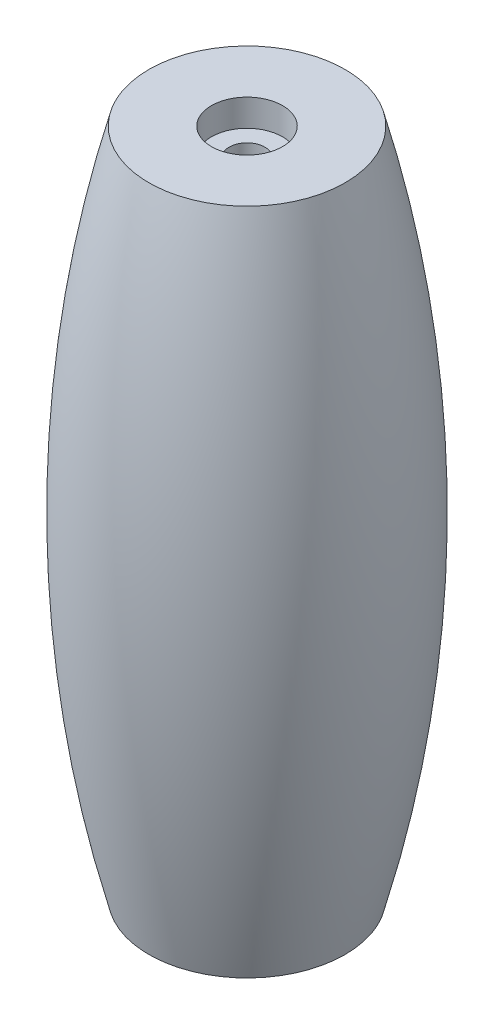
from build123d import *

# Parameters (mm, degrees)
SKETCH7_R          = 1.25
CUT_EXTRUDE6_DEPTH = 57.142405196
SKETCH8_R          = 2.5
CUT_EXTRUDE7_DEPTH = 1.9
CUT_EXTRUDE8_START = -1.9
SKETCH9_R          = 2.5
CUT_EXTRUDE8_DEPTH = 1.9
SCALE1_SCALE       = 0.95
SCALE2_SCALE       = 1.052631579
SCALE3_SCALE       = 0.94


with BuildPart() as part:
    # Sketch4 → Revolve2 (revolve)
    with BuildSketch(Plane.XY, mode=Mode.PRIVATE) as revolve2_sk:
        with BuildLine():
            ThreePointArc((-12.188062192, 14.080894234), (-9.13116282, -9.419105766), (-12.188062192, -32.919105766))
            Line((-12.188062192, -32.919105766), (-19.089678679, -32.919105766))
            Line((-19.089678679, -32.919105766), (-19.089678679, 14.080894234))
            Line((-19.089678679, 14.080894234), (-12.188062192, 14.080894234))
        make_face()
    revolve(revolve2_sk.sketch.rotate(Axis((-19.089678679, 14.080894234, 0), (0, -1, 0)), 180), axis=Axis((-19.089678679, 14.080894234, 0), (0, -1, 0)))

    # Sketch7 → Cut-Extrude6 (cut, through all)
    with BuildSketch(Plane(origin=(0, 14.080894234, 0), x_dir=(1, 0, 0), z_dir=(0, 1, 0))):
        with Locations(Location((-19.089678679, 0, 0), (0, 0, 180))):
            Circle(SKETCH7_R)
    extrude(amount=-CUT_EXTRUDE6_DEPTH, mode=Mode.SUBTRACT)

    # Sketch8 → Cut-Extrude7 (cut)
    with BuildSketch(Plane.XZ.offset(32.919105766)):
        with Locations((-19.089678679, 0)):
            Circle(SKETCH8_R)
    extrude(amount=-CUT_EXTRUDE7_DEPTH, mode=Mode.SUBTRACT)

    # Sketch9 → Cut-Extrude8 (cut)
    with BuildSketch(Plane(origin=(0, 14.080894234, 0), x_dir=(1, 0, 0), z_dir=(0, 1, 0)).offset(CUT_EXTRUDE8_START)):
        with Locations((-19.089678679, 0)):
            Circle(SKETCH9_R)
    extrude(amount=CUT_EXTRUDE8_DEPTH, mode=Mode.SUBTRACT)


with BuildPart() as part_1:
    # Scale1: scaled about (-19.089678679, -9.419105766, 0)
    add(part.part.scale(SCALE1_SCALE).moved(Location((-0.954483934, -0.470955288, 0))))


with BuildPart() as part_2:
    # Scale2: scaled about (-19.089678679, -9.419105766, 0)
    add(part_1.part.scale(SCALE2_SCALE).moved(Location((1.00471993, 0.495742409, 0))))


with BuildPart() as part_3:
    # Scale3: scaled about (-19.089678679, -9.419105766, 0)
    add(part_2.part.scale(SCALE3_SCALE).moved(Location((-1.145380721, -0.565146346, 0))))


solid = part_3.part
